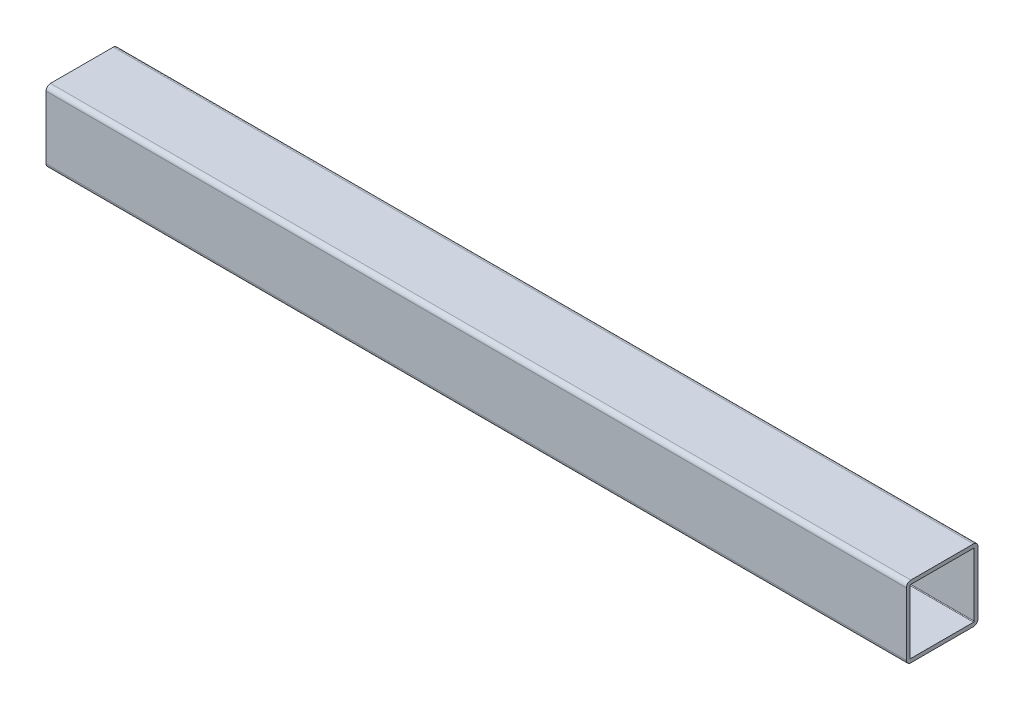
ISO-10303-21;
HEADER;
FILE_DESCRIPTION(('STEP AP214'),'2;1');
FILE_NAME('part.step','',(''),(''),'','','');
FILE_SCHEMA(('AUTOMOTIVE_DESIGN { 1 0 10303 214 1 1 1 1 }'));
ENDSEC;
DATA;
#1=APPLICATION_CONTEXT('core data for automotive mechanical design processes');
#2=APPLICATION_PROTOCOL_DEFINITION('international standard','automotive_design',2000,#1);
#3=PRODUCT_CONTEXT('',#1,'mechanical');
#4=PRODUCT('Part','Part','',(#3));
#5=PRODUCT_RELATED_PRODUCT_CATEGORY('part','',(#4));
#6=PRODUCT_DEFINITION_FORMATION('','',#4);
#7=PRODUCT_DEFINITION_CONTEXT('part definition',#1,'design');
#8=PRODUCT_DEFINITION('design','',#6,#7);
#9=PRODUCT_DEFINITION_SHAPE('','',#8);
#10=(LENGTH_UNIT() NAMED_UNIT(*) SI_UNIT(.MILLI.,.METRE.));
#11=(NAMED_UNIT(*) PLANE_ANGLE_UNIT() SI_UNIT($,.RADIAN.));
#12=(NAMED_UNIT(*) SI_UNIT($,.STERADIAN.) SOLID_ANGLE_UNIT());
#13=UNCERTAINTY_MEASURE_WITH_UNIT(LENGTH_MEASURE(1.E-05),#10,'distance_accuracy_value','');
#14=(GEOMETRIC_REPRESENTATION_CONTEXT(3) GLOBAL_UNCERTAINTY_ASSIGNED_CONTEXT((#13)) GLOBAL_UNIT_ASSIGNED_CONTEXT((#10,
#11,#12)) REPRESENTATION_CONTEXT('',''));
#15=CARTESIAN_POINT('',(0.,0.,0.));
#16=DIRECTION('',(0.,0.,1.));
#17=DIRECTION('',(1.,0.,0.));
#18=AXIS2_PLACEMENT_3D('',#15,#16,#17);
#19=CARTESIAN_POINT('',(304.8,3.65674086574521,-16.8519621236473));
#20=DIRECTION('',(-1.,0.,0.));
#21=DIRECTION('',(0.,0.,1.));
#22=AXIS2_PLACEMENT_3D('',#19,#20,#21);
#23=PLANE('',#22);
#24=CARTESIAN_POINT('',(304.8,3.65674086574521,-16.8519621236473));
#25=DIRECTION('',(1.,0.,0.));
#26=DIRECTION('',(0.,0.,1.));
#27=AXIS2_PLACEMENT_3D('',#24,#25,#26);
#28=CIRCLE('',#27,1.5875);
#29=CARTESIAN_POINT('',(304.8,3.6567408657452,-18.4394621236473));
#30=VERTEX_POINT('',#29);
#31=CARTESIAN_POINT('',(304.8,5.24424086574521,-16.8519621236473));
#32=VERTEX_POINT('',#31);
#33=EDGE_CURVE('E211',#30,#32,#28,.T.);
#34=ORIENTED_EDGE('',*,*,#33,.T.);
#35=DIRECTION('',(0.,0.,1.));
#36=VECTOR('',#35,1.);
#37=CARTESIAN_POINT('',(304.8,5.24424086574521,5.37303787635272));
#38=LINE('',#37,#36);
#39=CARTESIAN_POINT('',(304.8,5.24424086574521,5.37303787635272));
#40=VERTEX_POINT('',#39);
#41=EDGE_CURVE('E214',#32,#40,#38,.T.);
#42=ORIENTED_EDGE('',*,*,#41,.T.);
#43=CARTESIAN_POINT('',(304.8,3.65674086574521,5.37303787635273));
#44=DIRECTION('',(1.,0.,0.));
#45=DIRECTION('',(0.,0.,1.));
#46=AXIS2_PLACEMENT_3D('',#43,#44,#45);
#47=CIRCLE('',#46,1.5875);
#48=CARTESIAN_POINT('',(304.8,3.6567408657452,6.96053787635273));
#49=VERTEX_POINT('',#48);
#50=EDGE_CURVE('E217',#40,#49,#47,.T.);
#51=ORIENTED_EDGE('',*,*,#50,.T.);
#52=DIRECTION('',(0.,-1.,0.));
#53=VECTOR('',#52,1.);
#54=CARTESIAN_POINT('',(304.8,3.6567408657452,6.96053787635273));
#55=LINE('',#54,#53);
#56=CARTESIAN_POINT('',(304.8,-18.5682591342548,6.96053787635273));
#57=VERTEX_POINT('',#56);
#58=EDGE_CURVE('E219',#49,#57,#55,.T.);
#59=ORIENTED_EDGE('',*,*,#58,.T.);
#60=CARTESIAN_POINT('',(304.8,-18.5682591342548,5.37303787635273));
#61=DIRECTION('',(1.,0.,0.));
#62=DIRECTION('',(0.,0.,1.));
#63=AXIS2_PLACEMENT_3D('',#60,#61,#62);
#64=CIRCLE('',#63,1.5875);
#65=CARTESIAN_POINT('',(304.8,-20.1557591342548,5.37303787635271));
#66=VERTEX_POINT('',#65);
#67=EDGE_CURVE('E221',#57,#66,#64,.T.);
#68=ORIENTED_EDGE('',*,*,#67,.T.);
#69=DIRECTION('',(0.,0.,-1.));
#70=VECTOR('',#69,1.);
#71=CARTESIAN_POINT('',(304.8,-20.1557591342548,5.37303787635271));
#72=LINE('',#71,#70);
#73=CARTESIAN_POINT('',(304.8,-20.1557591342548,-16.8519621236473));
#74=VERTEX_POINT('',#73);
#75=EDGE_CURVE('E223',#66,#74,#72,.T.);
#76=ORIENTED_EDGE('',*,*,#75,.T.);
#77=CARTESIAN_POINT('',(304.8,-18.5682591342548,-16.8519621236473));
#78=DIRECTION('',(1.,0.,0.));
#79=DIRECTION('',(0.,0.,1.));
#80=AXIS2_PLACEMENT_3D('',#77,#78,#79);
#81=CIRCLE('',#80,1.5875);
#82=CARTESIAN_POINT('',(304.8,-18.5682591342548,-18.4394621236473));
#83=VERTEX_POINT('',#82);
#84=EDGE_CURVE('E225',#74,#83,#81,.T.);
#85=ORIENTED_EDGE('',*,*,#84,.T.);
#86=DIRECTION('',(0.,1.,0.));
#87=VECTOR('',#86,1.);
#88=CARTESIAN_POINT('',(304.8,3.6567408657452,-18.4394621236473));
#89=LINE('',#88,#87);
#90=EDGE_CURVE('E227',#83,#30,#89,.T.);
#91=ORIENTED_EDGE('',*,*,#90,.T.);
#92=EDGE_LOOP('',(#34,#42,#51,#59,#68,#76,#85,#91));
#93=FACE_BOUND('',#92,.T.);
#94=CARTESIAN_POINT('',(304.8,3.65674086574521,5.37303787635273));
#95=DIRECTION('',(1.,0.,0.));
#96=DIRECTION('',(0.,0.,1.));
#97=AXIS2_PLACEMENT_3D('',#94,#95,#96);
#98=CIRCLE('',#97,0.2413);
#99=CARTESIAN_POINT('',(304.8,3.89804086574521,5.37303787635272));
#100=VERTEX_POINT('',#99);
#101=CARTESIAN_POINT('',(304.8,3.6567408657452,5.61433787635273));
#102=VERTEX_POINT('',#101);
#103=EDGE_CURVE('E146',#100,#102,#98,.T.);
#104=ORIENTED_EDGE('',*,*,#103,.F.);
#105=DIRECTION('',(0.,0.,1.));
#106=VECTOR('',#105,1.);
#107=CARTESIAN_POINT('',(304.8,3.89804086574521,5.37303787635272));
#108=LINE('',#107,#106);
#109=CARTESIAN_POINT('',(304.8,3.89804086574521,-16.8519621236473));
#110=VERTEX_POINT('',#109);
#111=EDGE_CURVE('E179',#110,#100,#108,.T.);
#112=ORIENTED_EDGE('',*,*,#111,.F.);
#113=CARTESIAN_POINT('',(304.8,3.65674086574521,-16.8519621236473));
#114=DIRECTION('',(1.,0.,0.));
#115=DIRECTION('',(0.,0.,1.));
#116=AXIS2_PLACEMENT_3D('',#113,#114,#115);
#117=CIRCLE('',#116,0.2413);
#118=CARTESIAN_POINT('',(304.8,3.65674086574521,-17.0932621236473));
#119=VERTEX_POINT('',#118);
#120=EDGE_CURVE('E177',#119,#110,#117,.T.);
#121=ORIENTED_EDGE('',*,*,#120,.F.);
#122=DIRECTION('',(0.,1.,0.));
#123=VECTOR('',#122,1.);
#124=CARTESIAN_POINT('',(304.8,3.65674086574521,-17.0932621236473));
#125=LINE('',#124,#123);
#126=CARTESIAN_POINT('',(304.8,-18.5682591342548,-17.0932621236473));
#127=VERTEX_POINT('',#126);
#128=EDGE_CURVE('E175',#127,#119,#125,.T.);
#129=ORIENTED_EDGE('',*,*,#128,.F.);
#130=CARTESIAN_POINT('',(304.8,-18.5682591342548,-16.8519621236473));
#131=DIRECTION('',(1.,0.,0.));
#132=DIRECTION('',(0.,0.,1.));
#133=AXIS2_PLACEMENT_3D('',#130,#131,#132);
#134=CIRCLE('',#133,0.241299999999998);
#135=CARTESIAN_POINT('',(304.8,-18.8095591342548,-16.8519621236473));
#136=VERTEX_POINT('',#135);
#137=EDGE_CURVE('E173',#136,#127,#134,.T.);
#138=ORIENTED_EDGE('',*,*,#137,.F.);
#139=DIRECTION('',(0.,0.,-1.));
#140=VECTOR('',#139,1.);
#141=CARTESIAN_POINT('',(304.8,-18.8095591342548,5.37303787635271));
#142=LINE('',#141,#140);
#143=CARTESIAN_POINT('',(304.8,-18.8095591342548,5.37303787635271));
#144=VERTEX_POINT('',#143);
#145=EDGE_CURVE('E169',#144,#136,#142,.T.);
#146=ORIENTED_EDGE('',*,*,#145,.F.);
#147=CARTESIAN_POINT('',(304.8,-18.5682591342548,5.37303787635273));
#148=DIRECTION('',(1.,0.,0.));
#149=DIRECTION('',(0.,0.,1.));
#150=AXIS2_PLACEMENT_3D('',#147,#148,#149);
#151=CIRCLE('',#150,0.241299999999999);
#152=CARTESIAN_POINT('',(304.8,-18.5682591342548,5.61433787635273));
#153=VERTEX_POINT('',#152);
#154=EDGE_CURVE('E167',#153,#144,#151,.T.);
#155=ORIENTED_EDGE('',*,*,#154,.F.);
#156=DIRECTION('',(0.,-1.,0.));
#157=VECTOR('',#156,1.);
#158=CARTESIAN_POINT('',(304.8,3.6567408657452,5.61433787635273));
#159=LINE('',#158,#157);
#160=EDGE_CURVE('E154',#102,#153,#159,.T.);
#161=ORIENTED_EDGE('',*,*,#160,.F.);
#162=EDGE_LOOP('',(#104,#112,#121,#129,#138,#146,#155,#161));
#163=FACE_BOUND('',#162,.T.);
#164=ADVANCED_FACE('F33',(#93,#163),#23,.F.);
#165=CARTESIAN_POINT('',(0.,3.65674086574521,-16.8519621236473));
#166=DIRECTION('',(-1.,0.,0.));
#167=DIRECTION('',(0.,0.,1.));
#168=AXIS2_PLACEMENT_3D('',#165,#166,#167);
#169=PLANE('',#168);
#170=CARTESIAN_POINT('',(0.,3.65674086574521,-16.8519621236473));
#171=DIRECTION('',(1.,0.,0.));
#172=DIRECTION('',(0.,0.,1.));
#173=AXIS2_PLACEMENT_3D('',#170,#171,#172);
#174=CIRCLE('',#173,1.5875);
#175=CARTESIAN_POINT('',(0.,3.6567408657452,-18.4394621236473));
#176=VERTEX_POINT('',#175);
#177=CARTESIAN_POINT('',(0.,5.24424086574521,-16.8519621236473));
#178=VERTEX_POINT('',#177);
#179=EDGE_CURVE('E162',#176,#178,#174,.T.);
#180=ORIENTED_EDGE('',*,*,#179,.F.);
#181=DIRECTION('',(0.,1.,0.));
#182=VECTOR('',#181,1.);
#183=CARTESIAN_POINT('',(0.,3.6567408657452,-18.4394621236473));
#184=LINE('',#183,#182);
#185=CARTESIAN_POINT('',(0.,-18.5682591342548,-18.4394621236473));
#186=VERTEX_POINT('',#185);
#187=EDGE_CURVE('E215',#186,#176,#184,.T.);
#188=ORIENTED_EDGE('',*,*,#187,.F.);
#189=CARTESIAN_POINT('',(0.,-18.5682591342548,-16.8519621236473));
#190=DIRECTION('',(1.,0.,0.));
#191=DIRECTION('',(0.,0.,1.));
#192=AXIS2_PLACEMENT_3D('',#189,#190,#191);
#193=CIRCLE('',#192,1.5875);
#194=CARTESIAN_POINT('',(0.,-20.1557591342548,-16.8519621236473));
#195=VERTEX_POINT('',#194);
#196=EDGE_CURVE('E242',#195,#186,#193,.T.);
#197=ORIENTED_EDGE('',*,*,#196,.F.);
#198=DIRECTION('',(0.,0.,-1.));
#199=VECTOR('',#198,1.);
#200=CARTESIAN_POINT('',(0.,-20.1557591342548,5.37303787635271));
#201=LINE('',#200,#199);
#202=CARTESIAN_POINT('',(0.,-20.1557591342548,5.37303787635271));
#203=VERTEX_POINT('',#202);
#204=EDGE_CURVE('E240',#203,#195,#201,.T.);
#205=ORIENTED_EDGE('',*,*,#204,.F.);
#206=CARTESIAN_POINT('',(0.,-18.5682591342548,5.37303787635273));
#207=DIRECTION('',(1.,0.,0.));
#208=DIRECTION('',(0.,0.,1.));
#209=AXIS2_PLACEMENT_3D('',#206,#207,#208);
#210=CIRCLE('',#209,1.5875);
#211=CARTESIAN_POINT('',(0.,-18.5682591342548,6.96053787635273));
#212=VERTEX_POINT('',#211);
#213=EDGE_CURVE('E238',#212,#203,#210,.T.);
#214=ORIENTED_EDGE('',*,*,#213,.F.);
#215=DIRECTION('',(0.,-1.,0.));
#216=VECTOR('',#215,1.);
#217=CARTESIAN_POINT('',(0.,3.6567408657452,6.96053787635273));
#218=LINE('',#217,#216);
#219=CARTESIAN_POINT('',(0.,3.6567408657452,6.96053787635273));
#220=VERTEX_POINT('',#219);
#221=EDGE_CURVE('E236',#220,#212,#218,.T.);
#222=ORIENTED_EDGE('',*,*,#221,.F.);
#223=CARTESIAN_POINT('',(0.,3.65674086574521,5.37303787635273));
#224=DIRECTION('',(1.,0.,0.));
#225=DIRECTION('',(0.,0.,1.));
#226=AXIS2_PLACEMENT_3D('',#223,#224,#225);
#227=CIRCLE('',#226,1.5875);
#228=CARTESIAN_POINT('',(0.,5.24424086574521,5.37303787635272));
#229=VERTEX_POINT('',#228);
#230=EDGE_CURVE('E234',#229,#220,#227,.T.);
#231=ORIENTED_EDGE('',*,*,#230,.F.);
#232=DIRECTION('',(0.,0.,1.));
#233=VECTOR('',#232,1.);
#234=CARTESIAN_POINT('',(0.,5.24424086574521,5.37303787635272));
#235=LINE('',#234,#233);
#236=EDGE_CURVE('E232',#178,#229,#235,.T.);
#237=ORIENTED_EDGE('',*,*,#236,.F.);
#238=EDGE_LOOP('',(#180,#188,#197,#205,#214,#222,#231,#237));
#239=FACE_BOUND('',#238,.T.);
#240=DIRECTION('',(0.,0.,1.));
#241=VECTOR('',#240,1.);
#242=CARTESIAN_POINT('',(0.,3.89804086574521,5.37303787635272));
#243=LINE('',#242,#241);
#244=CARTESIAN_POINT('',(0.,3.89804086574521,-16.8519621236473));
#245=VERTEX_POINT('',#244);
#246=CARTESIAN_POINT('',(0.,3.89804086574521,5.37303787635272));
#247=VERTEX_POINT('',#246);
#248=EDGE_CURVE('E155',#245,#247,#243,.T.);
#249=ORIENTED_EDGE('',*,*,#248,.T.);
#250=CARTESIAN_POINT('',(0.,3.65674086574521,5.37303787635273));
#251=DIRECTION('',(1.,0.,0.));
#252=DIRECTION('',(0.,0.,1.));
#253=AXIS2_PLACEMENT_3D('',#250,#251,#252);
#254=CIRCLE('',#253,0.2413);
#255=CARTESIAN_POINT('',(0.,3.6567408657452,5.61433787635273));
#256=VERTEX_POINT('',#255);
#257=EDGE_CURVE('E56',#247,#256,#254,.T.);
#258=ORIENTED_EDGE('',*,*,#257,.T.);
#259=DIRECTION('',(0.,-1.,0.));
#260=VECTOR('',#259,1.);
#261=CARTESIAN_POINT('',(0.,3.6567408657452,5.61433787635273));
#262=LINE('',#261,#260);
#263=CARTESIAN_POINT('',(0.,-18.5682591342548,5.61433787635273));
#264=VERTEX_POINT('',#263);
#265=EDGE_CURVE('E161',#256,#264,#262,.T.);
#266=ORIENTED_EDGE('',*,*,#265,.T.);
#267=CARTESIAN_POINT('',(0.,-18.5682591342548,5.37303787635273));
#268=DIRECTION('',(1.,0.,0.));
#269=DIRECTION('',(0.,0.,1.));
#270=AXIS2_PLACEMENT_3D('',#267,#268,#269);
#271=CIRCLE('',#270,0.241299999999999);
#272=CARTESIAN_POINT('',(0.,-18.8095591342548,5.37303787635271));
#273=VERTEX_POINT('',#272);
#274=EDGE_CURVE('E183',#264,#273,#271,.T.);
#275=ORIENTED_EDGE('',*,*,#274,.T.);
#276=DIRECTION('',(0.,0.,-1.));
#277=VECTOR('',#276,1.);
#278=CARTESIAN_POINT('',(0.,-18.8095591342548,5.37303787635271));
#279=LINE('',#278,#277);
#280=CARTESIAN_POINT('',(0.,-18.8095591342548,-16.8519621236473));
#281=VERTEX_POINT('',#280);
#282=EDGE_CURVE('E186',#273,#281,#279,.T.);
#283=ORIENTED_EDGE('',*,*,#282,.T.);
#284=CARTESIAN_POINT('',(0.,-18.5682591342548,-16.8519621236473));
#285=DIRECTION('',(1.,0.,0.));
#286=DIRECTION('',(0.,0.,1.));
#287=AXIS2_PLACEMENT_3D('',#284,#285,#286);
#288=CIRCLE('',#287,0.241299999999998);
#289=CARTESIAN_POINT('',(0.,-18.5682591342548,-17.0932621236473));
#290=VERTEX_POINT('',#289);
#291=EDGE_CURVE('E189',#281,#290,#288,.T.);
#292=ORIENTED_EDGE('',*,*,#291,.T.);
#293=DIRECTION('',(0.,1.,0.));
#294=VECTOR('',#293,1.);
#295=CARTESIAN_POINT('',(0.,3.65674086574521,-17.0932621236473));
#296=LINE('',#295,#294);
#297=CARTESIAN_POINT('',(0.,3.65674086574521,-17.0932621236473));
#298=VERTEX_POINT('',#297);
#299=EDGE_CURVE('E192',#290,#298,#296,.T.);
#300=ORIENTED_EDGE('',*,*,#299,.T.);
#301=CARTESIAN_POINT('',(0.,3.65674086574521,-16.8519621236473));
#302=DIRECTION('',(1.,0.,0.));
#303=DIRECTION('',(0.,0.,1.));
#304=AXIS2_PLACEMENT_3D('',#301,#302,#303);
#305=CIRCLE('',#304,0.2413);
#306=EDGE_CURVE('E195',#298,#245,#305,.T.);
#307=ORIENTED_EDGE('',*,*,#306,.T.);
#308=EDGE_LOOP('',(#249,#258,#266,#275,#283,#292,#300,#307));
#309=FACE_BOUND('',#308,.T.);
#310=ADVANCED_FACE('F272',(#239,#309),#169,.T.);
#311=CARTESIAN_POINT('',(304.8,3.65674086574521,-16.8519621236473));
#312=DIRECTION('',(-1.,0.,0.));
#313=DIRECTION('',(0.,0.,1.));
#314=AXIS2_PLACEMENT_3D('',#311,#312,#313);
#315=CYLINDRICAL_SURFACE('',#314,1.5875);
#316=ORIENTED_EDGE('',*,*,#179,.T.);
#317=DIRECTION('',(-1.,0.,0.));
#318=VECTOR('',#317,1.);
#319=CARTESIAN_POINT('',(304.8,5.24424086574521,-16.8519621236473));
#320=LINE('',#319,#318);
#321=EDGE_CURVE('E11',#32,#178,#320,.T.);
#322=ORIENTED_EDGE('',*,*,#321,.F.);
#323=ORIENTED_EDGE('',*,*,#33,.F.);
#324=DIRECTION('',(-1.,0.,0.));
#325=VECTOR('',#324,1.);
#326=CARTESIAN_POINT('',(304.8,3.6567408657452,-18.4394621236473));
#327=LINE('',#326,#325);
#328=EDGE_CURVE('E229',#30,#176,#327,.T.);
#329=ORIENTED_EDGE('',*,*,#328,.T.);
#330=EDGE_LOOP('',(#316,#322,#323,#329));
#331=FACE_BOUND('',#330,.T.);
#332=ADVANCED_FACE('F35',(#331),#315,.T.);
#333=CARTESIAN_POINT('',(304.8,5.24424086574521,5.37303787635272));
#334=DIRECTION('',(0.,-1.,0.));
#335=DIRECTION('',(0.,0.,-1.));
#336=AXIS2_PLACEMENT_3D('',#333,#334,#335);
#337=PLANE('',#336);
#338=ORIENTED_EDGE('',*,*,#236,.T.);
#339=DIRECTION('',(-1.,0.,0.));
#340=VECTOR('',#339,1.);
#341=CARTESIAN_POINT('',(304.8,5.24424086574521,5.37303787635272));
#342=LINE('',#341,#340);
#343=EDGE_CURVE('E41',#40,#229,#342,.T.);
#344=ORIENTED_EDGE('',*,*,#343,.F.);
#345=ORIENTED_EDGE('',*,*,#41,.F.);
#346=ORIENTED_EDGE('',*,*,#321,.T.);
#347=EDGE_LOOP('',(#338,#344,#345,#346));
#348=FACE_BOUND('',#347,.T.);
#349=ADVANCED_FACE('F289',(#348),#337,.F.);
#350=CARTESIAN_POINT('',(304.8,3.65674086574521,5.37303787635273));
#351=DIRECTION('',(-1.,0.,0.));
#352=DIRECTION('',(0.,0.,1.));
#353=AXIS2_PLACEMENT_3D('',#350,#351,#352);
#354=CYLINDRICAL_SURFACE('',#353,1.5875);
#355=ORIENTED_EDGE('',*,*,#230,.T.);
#356=DIRECTION('',(-1.,0.,0.));
#357=VECTOR('',#356,1.);
#358=CARTESIAN_POINT('',(304.8,3.6567408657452,6.96053787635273));
#359=LINE('',#358,#357);
#360=EDGE_CURVE('E259',#49,#220,#359,.T.);
#361=ORIENTED_EDGE('',*,*,#360,.F.);
#362=ORIENTED_EDGE('',*,*,#50,.F.);
#363=ORIENTED_EDGE('',*,*,#343,.T.);
#364=EDGE_LOOP('',(#355,#361,#362,#363));
#365=FACE_BOUND('',#364,.T.);
#366=ADVANCED_FACE('F266',(#365),#354,.T.);
#367=CARTESIAN_POINT('',(304.8,3.6567408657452,6.96053787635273));
#368=DIRECTION('',(0.,0.,-1.));
#369=DIRECTION('',(0.,1.,0.));
#370=AXIS2_PLACEMENT_3D('',#367,#368,#369);
#371=PLANE('',#370);
#372=ORIENTED_EDGE('',*,*,#221,.T.);
#373=DIRECTION('',(-1.,0.,0.));
#374=VECTOR('',#373,1.);
#375=CARTESIAN_POINT('',(304.8,-18.5682591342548,6.96053787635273));
#376=LINE('',#375,#374);
#377=EDGE_CURVE('E256',#57,#212,#376,.T.);
#378=ORIENTED_EDGE('',*,*,#377,.F.);
#379=ORIENTED_EDGE('',*,*,#58,.F.);
#380=ORIENTED_EDGE('',*,*,#360,.T.);
#381=EDGE_LOOP('',(#372,#378,#379,#380));
#382=FACE_BOUND('',#381,.T.);
#383=ADVANCED_FACE('F278',(#382),#371,.F.);
#384=CARTESIAN_POINT('',(304.8,-18.5682591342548,5.37303787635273));
#385=DIRECTION('',(-1.,0.,0.));
#386=DIRECTION('',(0.,0.,1.));
#387=AXIS2_PLACEMENT_3D('',#384,#385,#386);
#388=CYLINDRICAL_SURFACE('',#387,1.5875);
#389=ORIENTED_EDGE('',*,*,#213,.T.);
#390=DIRECTION('',(-1.,0.,0.));
#391=VECTOR('',#390,1.);
#392=CARTESIAN_POINT('',(304.8,-20.1557591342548,5.37303787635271));
#393=LINE('',#392,#391);
#394=EDGE_CURVE('E253',#66,#203,#393,.T.);
#395=ORIENTED_EDGE('',*,*,#394,.F.);
#396=ORIENTED_EDGE('',*,*,#67,.F.);
#397=ORIENTED_EDGE('',*,*,#377,.T.);
#398=EDGE_LOOP('',(#389,#395,#396,#397));
#399=FACE_BOUND('',#398,.T.);
#400=ADVANCED_FACE('F282',(#399),#388,.T.);
#401=CARTESIAN_POINT('',(304.8,-20.1557591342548,5.37303787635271));
#402=DIRECTION('',(0.,1.,0.));
#403=DIRECTION('',(0.,0.,1.));
#404=AXIS2_PLACEMENT_3D('',#401,#402,#403);
#405=PLANE('',#404);
#406=ORIENTED_EDGE('',*,*,#204,.T.);
#407=DIRECTION('',(-1.,0.,0.));
#408=VECTOR('',#407,1.);
#409=CARTESIAN_POINT('',(304.8,-20.1557591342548,-16.8519621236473));
#410=LINE('',#409,#408);
#411=EDGE_CURVE('E250',#74,#195,#410,.T.);
#412=ORIENTED_EDGE('',*,*,#411,.F.);
#413=ORIENTED_EDGE('',*,*,#75,.F.);
#414=ORIENTED_EDGE('',*,*,#394,.T.);
#415=EDGE_LOOP('',(#406,#412,#413,#414));
#416=FACE_BOUND('',#415,.T.);
#417=ADVANCED_FACE('F302',(#416),#405,.F.);
#418=CARTESIAN_POINT('',(304.8,-18.5682591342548,-16.8519621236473));
#419=DIRECTION('',(-1.,0.,0.));
#420=DIRECTION('',(0.,0.,1.));
#421=AXIS2_PLACEMENT_3D('',#418,#419,#420);
#422=CYLINDRICAL_SURFACE('',#421,1.5875);
#423=ORIENTED_EDGE('',*,*,#196,.T.);
#424=DIRECTION('',(-1.,0.,0.));
#425=VECTOR('',#424,1.);
#426=CARTESIAN_POINT('',(304.8,-18.5682591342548,-18.4394621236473));
#427=LINE('',#426,#425);
#428=EDGE_CURVE('E247',#83,#186,#427,.T.);
#429=ORIENTED_EDGE('',*,*,#428,.F.);
#430=ORIENTED_EDGE('',*,*,#84,.F.);
#431=ORIENTED_EDGE('',*,*,#411,.T.);
#432=EDGE_LOOP('',(#423,#429,#430,#431));
#433=FACE_BOUND('',#432,.T.);
#434=ADVANCED_FACE('F300',(#433),#422,.T.);
#435=CARTESIAN_POINT('',(304.8,3.6567408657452,-18.4394621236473));
#436=DIRECTION('',(0.,0.,1.));
#437=DIRECTION('',(0.,-1.,0.));
#438=AXIS2_PLACEMENT_3D('',#435,#436,#437);
#439=PLANE('',#438);
#440=ORIENTED_EDGE('',*,*,#187,.T.);
#441=ORIENTED_EDGE('',*,*,#328,.F.);
#442=ORIENTED_EDGE('',*,*,#90,.F.);
#443=ORIENTED_EDGE('',*,*,#428,.T.);
#444=EDGE_LOOP('',(#440,#441,#442,#443));
#445=FACE_BOUND('',#444,.T.);
#446=ADVANCED_FACE('F295',(#445),#439,.F.);
#447=CARTESIAN_POINT('',(304.8,3.65674086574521,5.37303787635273));
#448=DIRECTION('',(-1.,0.,0.));
#449=DIRECTION('',(0.,0.,1.));
#450=AXIS2_PLACEMENT_3D('',#447,#448,#449);
#451=CYLINDRICAL_SURFACE('',#450,0.2413);
#452=ORIENTED_EDGE('',*,*,#257,.F.);
#453=DIRECTION('',(-1.,0.,0.));
#454=VECTOR('',#453,1.);
#455=CARTESIAN_POINT('',(304.8,3.89804086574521,5.37303787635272));
#456=LINE('',#455,#454);
#457=EDGE_CURVE('E150',#100,#247,#456,.T.);
#458=ORIENTED_EDGE('',*,*,#457,.F.);
#459=ORIENTED_EDGE('',*,*,#103,.T.);
#460=DIRECTION('',(-1.,0.,0.));
#461=VECTOR('',#460,1.);
#462=CARTESIAN_POINT('',(304.8,3.6567408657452,5.61433787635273));
#463=LINE('',#462,#461);
#464=EDGE_CURVE('E149',#102,#256,#463,.T.);
#465=ORIENTED_EDGE('',*,*,#464,.T.);
#466=EDGE_LOOP('',(#452,#458,#459,#465));
#467=FACE_BOUND('',#466,.T.);
#468=ADVANCED_FACE('F148',(#467),#451,.F.);
#469=CARTESIAN_POINT('',(304.8,3.6567408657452,5.61433787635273));
#470=DIRECTION('',(0.,0.,-1.));
#471=DIRECTION('',(0.,1.,0.));
#472=AXIS2_PLACEMENT_3D('',#469,#470,#471);
#473=PLANE('',#472);
#474=ORIENTED_EDGE('',*,*,#265,.F.);
#475=ORIENTED_EDGE('',*,*,#464,.F.);
#476=ORIENTED_EDGE('',*,*,#160,.T.);
#477=DIRECTION('',(-1.,0.,0.));
#478=VECTOR('',#477,1.);
#479=CARTESIAN_POINT('',(304.8,-18.5682591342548,5.61433787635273));
#480=LINE('',#479,#478);
#481=EDGE_CURVE('E163',#153,#264,#480,.T.);
#482=ORIENTED_EDGE('',*,*,#481,.T.);
#483=EDGE_LOOP('',(#474,#475,#476,#482));
#484=FACE_BOUND('',#483,.T.);
#485=ADVANCED_FACE('F158',(#484),#473,.T.);
#486=CARTESIAN_POINT('',(304.8,-18.5682591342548,5.37303787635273));
#487=DIRECTION('',(-1.,0.,0.));
#488=DIRECTION('',(0.,0.,1.));
#489=AXIS2_PLACEMENT_3D('',#486,#487,#488);
#490=CYLINDRICAL_SURFACE('',#489,0.241299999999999);
#491=ORIENTED_EDGE('',*,*,#274,.F.);
#492=ORIENTED_EDGE('',*,*,#481,.F.);
#493=ORIENTED_EDGE('',*,*,#154,.T.);
#494=DIRECTION('',(-1.,0.,0.));
#495=VECTOR('',#494,1.);
#496=CARTESIAN_POINT('',(304.8,-18.8095591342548,5.37303787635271));
#497=LINE('',#496,#495);
#498=EDGE_CURVE('E208',#144,#273,#497,.T.);
#499=ORIENTED_EDGE('',*,*,#498,.T.);
#500=EDGE_LOOP('',(#491,#492,#493,#499));
#501=FACE_BOUND('',#500,.T.);
#502=ADVANCED_FACE('F327',(#501),#490,.F.);
#503=CARTESIAN_POINT('',(304.8,-18.8095591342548,5.37303787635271));
#504=DIRECTION('',(0.,1.,0.));
#505=DIRECTION('',(0.,0.,1.));
#506=AXIS2_PLACEMENT_3D('',#503,#504,#505);
#507=PLANE('',#506);
#508=ORIENTED_EDGE('',*,*,#282,.F.);
#509=ORIENTED_EDGE('',*,*,#498,.F.);
#510=ORIENTED_EDGE('',*,*,#145,.T.);
#511=DIRECTION('',(-1.,0.,0.));
#512=VECTOR('',#511,1.);
#513=CARTESIAN_POINT('',(304.8,-18.8095591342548,-16.8519621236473));
#514=LINE('',#513,#512);
#515=EDGE_CURVE('E206',#136,#281,#514,.T.);
#516=ORIENTED_EDGE('',*,*,#515,.T.);
#517=EDGE_LOOP('',(#508,#509,#510,#516));
#518=FACE_BOUND('',#517,.T.);
#519=ADVANCED_FACE('F331',(#518),#507,.T.);
#520=CARTESIAN_POINT('',(304.8,-18.5682591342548,-16.8519621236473));
#521=DIRECTION('',(-1.,0.,0.));
#522=DIRECTION('',(0.,0.,1.));
#523=AXIS2_PLACEMENT_3D('',#520,#521,#522);
#524=CYLINDRICAL_SURFACE('',#523,0.241299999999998);
#525=ORIENTED_EDGE('',*,*,#291,.F.);
#526=ORIENTED_EDGE('',*,*,#515,.F.);
#527=ORIENTED_EDGE('',*,*,#137,.T.);
#528=DIRECTION('',(-1.,0.,0.));
#529=VECTOR('',#528,1.);
#530=CARTESIAN_POINT('',(304.8,-18.5682591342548,-17.0932621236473));
#531=LINE('',#530,#529);
#532=EDGE_CURVE('E204',#127,#290,#531,.T.);
#533=ORIENTED_EDGE('',*,*,#532,.T.);
#534=EDGE_LOOP('',(#525,#526,#527,#533));
#535=FACE_BOUND('',#534,.T.);
#536=ADVANCED_FACE('F337',(#535),#524,.F.);
#537=CARTESIAN_POINT('',(304.8,3.65674086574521,-17.0932621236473));
#538=DIRECTION('',(0.,0.,1.));
#539=DIRECTION('',(1.,0.,0.));
#540=AXIS2_PLACEMENT_3D('',#537,#538,#539);
#541=PLANE('',#540);
#542=ORIENTED_EDGE('',*,*,#299,.F.);
#543=ORIENTED_EDGE('',*,*,#532,.F.);
#544=ORIENTED_EDGE('',*,*,#128,.T.);
#545=DIRECTION('',(-1.,0.,0.));
#546=VECTOR('',#545,1.);
#547=CARTESIAN_POINT('',(304.8,3.65674086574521,-17.0932621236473));
#548=LINE('',#547,#546);
#549=EDGE_CURVE('E202',#119,#298,#548,.T.);
#550=ORIENTED_EDGE('',*,*,#549,.T.);
#551=EDGE_LOOP('',(#542,#543,#544,#550));
#552=FACE_BOUND('',#551,.T.);
#553=ADVANCED_FACE('F341',(#552),#541,.T.);
#554=CARTESIAN_POINT('',(304.8,3.65674086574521,-16.8519621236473));
#555=DIRECTION('',(-1.,0.,0.));
#556=DIRECTION('',(0.,0.,1.));
#557=AXIS2_PLACEMENT_3D('',#554,#555,#556);
#558=CYLINDRICAL_SURFACE('',#557,0.2413);
#559=ORIENTED_EDGE('',*,*,#306,.F.);
#560=ORIENTED_EDGE('',*,*,#549,.F.);
#561=ORIENTED_EDGE('',*,*,#120,.T.);
#562=DIRECTION('',(-1.,0.,0.));
#563=VECTOR('',#562,1.);
#564=CARTESIAN_POINT('',(304.8,3.89804086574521,-16.8519621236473));
#565=LINE('',#564,#563);
#566=EDGE_CURVE('E48',#110,#245,#565,.T.);
#567=ORIENTED_EDGE('',*,*,#566,.T.);
#568=EDGE_LOOP('',(#559,#560,#561,#567));
#569=FACE_BOUND('',#568,.T.);
#570=ADVANCED_FACE('F345',(#569),#558,.F.);
#571=CARTESIAN_POINT('',(304.8,3.89804086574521,5.37303787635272));
#572=DIRECTION('',(0.,-1.,0.));
#573=DIRECTION('',(0.,0.,-1.));
#574=AXIS2_PLACEMENT_3D('',#571,#572,#573);
#575=PLANE('',#574);
#576=ORIENTED_EDGE('',*,*,#248,.F.);
#577=ORIENTED_EDGE('',*,*,#566,.F.);
#578=ORIENTED_EDGE('',*,*,#111,.T.);
#579=ORIENTED_EDGE('',*,*,#457,.T.);
#580=EDGE_LOOP('',(#576,#577,#578,#579));
#581=FACE_BOUND('',#580,.T.);
#582=ADVANCED_FACE('F349',(#581),#575,.T.);
#583=CLOSED_SHELL('',(#164,#310,#332,#349,#366,#383,#400,#417,#434,#446,#468,#485,#502,#519,
#536,#553,#570,#582));
#584=MANIFOLD_SOLID_BREP('B2',#583);
#585=ADVANCED_BREP_SHAPE_REPRESENTATION('',(#18,#584),#14);
#586=SHAPE_DEFINITION_REPRESENTATION(#9,#585);
ENDSEC;
END-ISO-10303-21;
